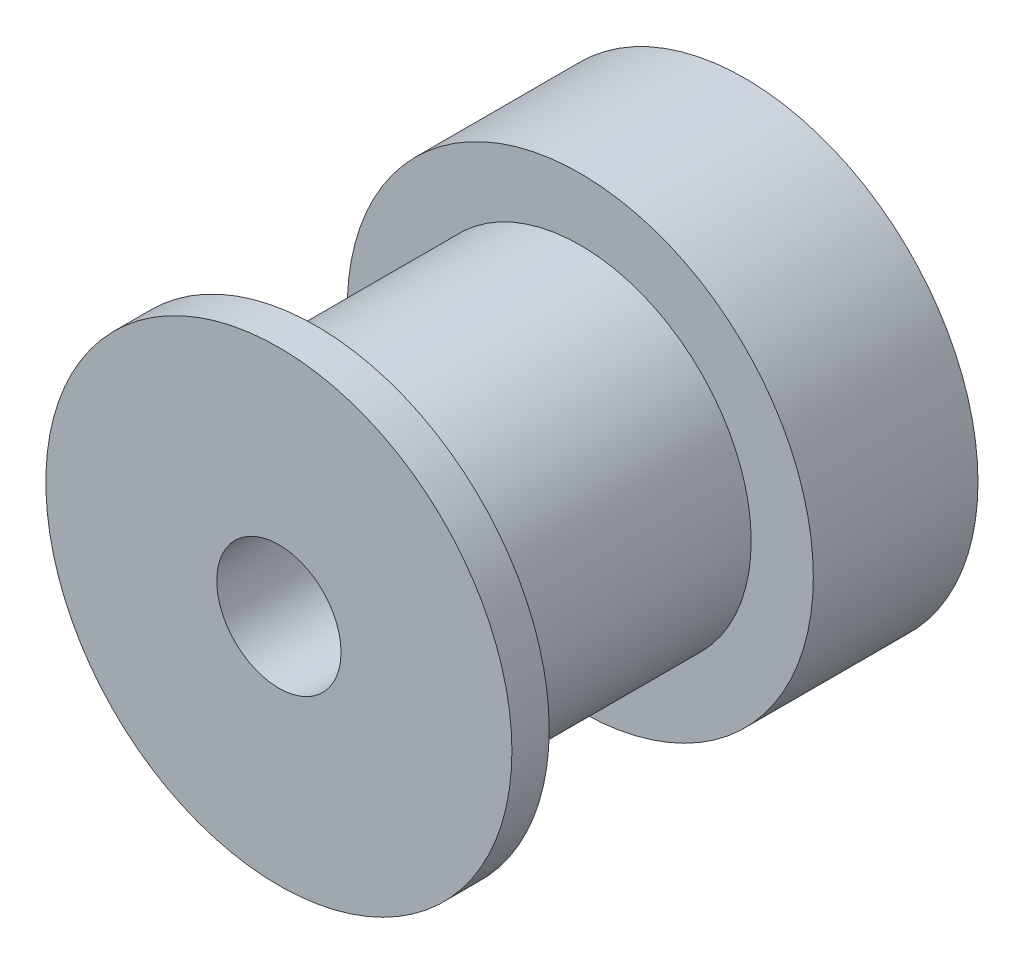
ISO-10303-21;
HEADER;
FILE_DESCRIPTION(('STEP AP214'),'2;1');
FILE_NAME('part.step','',(''),(''),'','','');
FILE_SCHEMA(('AUTOMOTIVE_DESIGN { 1 0 10303 214 1 1 1 1 }'));
ENDSEC;
DATA;
#1=APPLICATION_CONTEXT('core data for automotive mechanical design processes');
#2=APPLICATION_PROTOCOL_DEFINITION('international standard','automotive_design',2000,#1);
#3=PRODUCT_CONTEXT('',#1,'mechanical');
#4=PRODUCT('Part','Part','',(#3));
#5=PRODUCT_RELATED_PRODUCT_CATEGORY('part','',(#4));
#6=PRODUCT_DEFINITION_FORMATION('','',#4);
#7=PRODUCT_DEFINITION_CONTEXT('part definition',#1,'design');
#8=PRODUCT_DEFINITION('design','',#6,#7);
#9=PRODUCT_DEFINITION_SHAPE('','',#8);
#10=(LENGTH_UNIT() NAMED_UNIT(*) SI_UNIT(.MILLI.,.METRE.));
#11=(NAMED_UNIT(*) PLANE_ANGLE_UNIT() SI_UNIT($,.RADIAN.));
#12=(NAMED_UNIT(*) SI_UNIT($,.STERADIAN.) SOLID_ANGLE_UNIT());
#13=UNCERTAINTY_MEASURE_WITH_UNIT(LENGTH_MEASURE(1.E-05),#10,'distance_accuracy_value','');
#14=(GEOMETRIC_REPRESENTATION_CONTEXT(3) GLOBAL_UNCERTAINTY_ASSIGNED_CONTEXT((#13)) GLOBAL_UNIT_ASSIGNED_CONTEXT((#10,
#11,#12)) REPRESENTATION_CONTEXT('',''));
#15=CARTESIAN_POINT('',(0.,0.,0.));
#16=DIRECTION('',(0.,0.,1.));
#17=DIRECTION('',(1.,0.,0.));
#18=AXIS2_PLACEMENT_3D('',#15,#16,#17);
#19=CARTESIAN_POINT('',(0.,0.,15.));
#20=DIRECTION('',(0.,0.,-1.));
#21=DIRECTION('',(-1.,0.,0.));
#22=AXIS2_PLACEMENT_3D('',#19,#20,#21);
#23=CYLINDRICAL_SURFACE('',#22,7.5);
#24=CARTESIAN_POINT('',(0.,0.,0.));
#25=DIRECTION('',(0.,0.,1.));
#26=DIRECTION('',(1.,0.,0.));
#27=AXIS2_PLACEMENT_3D('',#24,#25,#26);
#28=CIRCLE('',#27,7.5);
#29=CARTESIAN_POINT('',(7.5,0.,0.));
#30=VERTEX_POINT('',#29);
#31=EDGE_CURVE('E38',#30,#30,#28,.T.);
#32=ORIENTED_EDGE('',*,*,#31,.T.);
#33=EDGE_LOOP('',(#32));
#34=FACE_BOUND('',#33,.T.);
#35=CARTESIAN_POINT('',(0.,0.,5.3));
#36=DIRECTION('',(0.,0.,1.));
#37=DIRECTION('',(1.,0.,0.));
#38=AXIS2_PLACEMENT_3D('',#35,#36,#37);
#39=CIRCLE('',#38,7.5);
#40=CARTESIAN_POINT('',(7.5,0.,5.3));
#41=VERTEX_POINT('',#40);
#42=EDGE_CURVE('E45',#41,#41,#39,.T.);
#43=ORIENTED_EDGE('',*,*,#42,.F.);
#44=EDGE_LOOP('',(#43));
#45=FACE_BOUND('',#44,.T.);
#46=ADVANCED_FACE('F34',(#34,#45),#23,.T.);
#47=CARTESIAN_POINT('',(0.,0.,0.));
#48=DIRECTION('',(0.,0.,1.));
#49=DIRECTION('',(1.,0.,0.));
#50=AXIS2_PLACEMENT_3D('',#47,#48,#49);
#51=PLANE('',#50);
#52=CARTESIAN_POINT('',(0.,0.,0.));
#53=DIRECTION('',(0.,0.,1.));
#54=DIRECTION('',(1.,0.,0.));
#55=AXIS2_PLACEMENT_3D('',#52,#53,#54);
#56=CIRCLE('',#55,2.);
#57=CARTESIAN_POINT('',(2.,0.,0.));
#58=VERTEX_POINT('',#57);
#59=EDGE_CURVE('E56',#58,#58,#56,.T.);
#60=ORIENTED_EDGE('',*,*,#59,.T.);
#61=EDGE_LOOP('',(#60));
#62=FACE_BOUND('',#61,.T.);
#63=ORIENTED_EDGE('',*,*,#31,.F.);
#64=EDGE_LOOP('',(#63));
#65=FACE_BOUND('',#64,.T.);
#66=ADVANCED_FACE('F65',(#62,#65),#51,.F.);
#67=CARTESIAN_POINT('',(0.,0.,5.3));
#68=DIRECTION('',(0.,0.,1.));
#69=DIRECTION('',(1.,0.,0.));
#70=AXIS2_PLACEMENT_3D('',#67,#68,#69);
#71=PLANE('',#70);
#72=CARTESIAN_POINT('',(0.,0.,5.3));
#73=DIRECTION('',(0.,0.,1.));
#74=DIRECTION('',(1.,0.,0.));
#75=AXIS2_PLACEMENT_3D('',#72,#73,#74);
#76=CIRCLE('',#75,5.5);
#77=CARTESIAN_POINT('',(5.5,0.,5.3));
#78=VERTEX_POINT('',#77);
#79=EDGE_CURVE('E50',#78,#78,#76,.T.);
#80=ORIENTED_EDGE('',*,*,#79,.F.);
#81=EDGE_LOOP('',(#80));
#82=FACE_BOUND('',#81,.T.);
#83=ORIENTED_EDGE('',*,*,#42,.T.);
#84=EDGE_LOOP('',(#83));
#85=FACE_BOUND('',#84,.T.);
#86=ADVANCED_FACE('F92',(#82,#85),#71,.T.);
#87=CARTESIAN_POINT('',(0.,0.,13.8));
#88=DIRECTION('',(0.,0.,1.));
#89=DIRECTION('',(1.,0.,0.));
#90=AXIS2_PLACEMENT_3D('',#87,#88,#89);
#91=PLANE('',#90);
#92=CARTESIAN_POINT('',(0.,0.,13.8));
#93=DIRECTION('',(0.,0.,1.));
#94=DIRECTION('',(1.,0.,0.));
#95=AXIS2_PLACEMENT_3D('',#92,#93,#94);
#96=CIRCLE('',#95,5.5);
#97=CARTESIAN_POINT('',(5.5,0.,13.8));
#98=VERTEX_POINT('',#97);
#99=EDGE_CURVE('E53',#98,#98,#96,.T.);
#100=ORIENTED_EDGE('',*,*,#99,.T.);
#101=EDGE_LOOP('',(#100));
#102=FACE_BOUND('',#101,.T.);
#103=CARTESIAN_POINT('',(0.,0.,13.8));
#104=DIRECTION('',(0.,0.,1.));
#105=DIRECTION('',(1.,0.,0.));
#106=AXIS2_PLACEMENT_3D('',#103,#104,#105);
#107=CIRCLE('',#106,7.5);
#108=CARTESIAN_POINT('',(7.5,0.,13.8));
#109=VERTEX_POINT('',#108);
#110=EDGE_CURVE('E47',#109,#109,#107,.T.);
#111=ORIENTED_EDGE('',*,*,#110,.F.);
#112=EDGE_LOOP('',(#111));
#113=FACE_BOUND('',#112,.T.);
#114=ADVANCED_FACE('F83',(#102,#113),#91,.F.);
#115=CARTESIAN_POINT('',(0.,0.,5.3));
#116=DIRECTION('',(0.,0.,1.));
#117=DIRECTION('',(1.,0.,0.));
#118=AXIS2_PLACEMENT_3D('',#115,#116,#117);
#119=CYLINDRICAL_SURFACE('',#118,5.5);
#120=ORIENTED_EDGE('',*,*,#79,.T.);
#121=EDGE_LOOP('',(#120));
#122=FACE_BOUND('',#121,.T.);
#123=ORIENTED_EDGE('',*,*,#99,.F.);
#124=EDGE_LOOP('',(#123));
#125=FACE_BOUND('',#124,.T.);
#126=ADVANCED_FACE('F76',(#122,#125),#119,.T.);
#127=CARTESIAN_POINT('',(0.,0.,15.));
#128=DIRECTION('',(0.,0.,1.));
#129=DIRECTION('',(1.,0.,0.));
#130=AXIS2_PLACEMENT_3D('',#127,#128,#129);
#131=PLANE('',#130);
#132=CARTESIAN_POINT('',(0.,0.,15.));
#133=DIRECTION('',(0.,0.,1.));
#134=DIRECTION('',(1.,0.,0.));
#135=AXIS2_PLACEMENT_3D('',#132,#133,#134);
#136=CIRCLE('',#135,2.);
#137=CARTESIAN_POINT('',(2.,0.,15.));
#138=VERTEX_POINT('',#137);
#139=EDGE_CURVE('E59',#138,#138,#136,.T.);
#140=ORIENTED_EDGE('',*,*,#139,.F.);
#141=EDGE_LOOP('',(#140));
#142=FACE_BOUND('',#141,.T.);
#143=CARTESIAN_POINT('',(0.,0.,15.));
#144=DIRECTION('',(0.,0.,1.));
#145=DIRECTION('',(1.,0.,0.));
#146=AXIS2_PLACEMENT_3D('',#143,#144,#145);
#147=CIRCLE('',#146,7.5);
#148=CARTESIAN_POINT('',(7.5,0.,15.));
#149=VERTEX_POINT('',#148);
#150=EDGE_CURVE('E10',#149,#149,#147,.T.);
#151=ORIENTED_EDGE('',*,*,#150,.T.);
#152=EDGE_LOOP('',(#151));
#153=FACE_BOUND('',#152,.T.);
#154=ADVANCED_FACE('F74',(#142,#153),#131,.T.);
#155=ORIENTED_EDGE('',*,*,#110,.T.);
#156=EDGE_LOOP('',(#155));
#157=FACE_BOUND('',#156,.T.);
#158=ORIENTED_EDGE('',*,*,#150,.F.);
#159=EDGE_LOOP('',(#158));
#160=FACE_BOUND('',#159,.T.);
#161=ADVANCED_FACE('F36',(#157,#160),#23,.T.);
#162=CARTESIAN_POINT('',(0.,0.,0.));
#163=DIRECTION('',(0.,0.,1.));
#164=DIRECTION('',(1.,0.,0.));
#165=AXIS2_PLACEMENT_3D('',#162,#163,#164);
#166=CYLINDRICAL_SURFACE('',#165,2.);
#167=ORIENTED_EDGE('',*,*,#59,.F.);
#168=EDGE_LOOP('',(#167));
#169=FACE_BOUND('',#168,.T.);
#170=ORIENTED_EDGE('',*,*,#139,.T.);
#171=EDGE_LOOP('',(#170));
#172=FACE_BOUND('',#171,.T.);
#173=ADVANCED_FACE('F68',(#169,#172),#166,.F.);
#174=CLOSED_SHELL('',(#46,#66,#86,#114,#126,#154,#161,#173));
#175=MANIFOLD_SOLID_BREP('B2',#174);
#176=ADVANCED_BREP_SHAPE_REPRESENTATION('',(#18,#175),#14);
#177=SHAPE_DEFINITION_REPRESENTATION(#9,#176);
ENDSEC;
END-ISO-10303-21;
